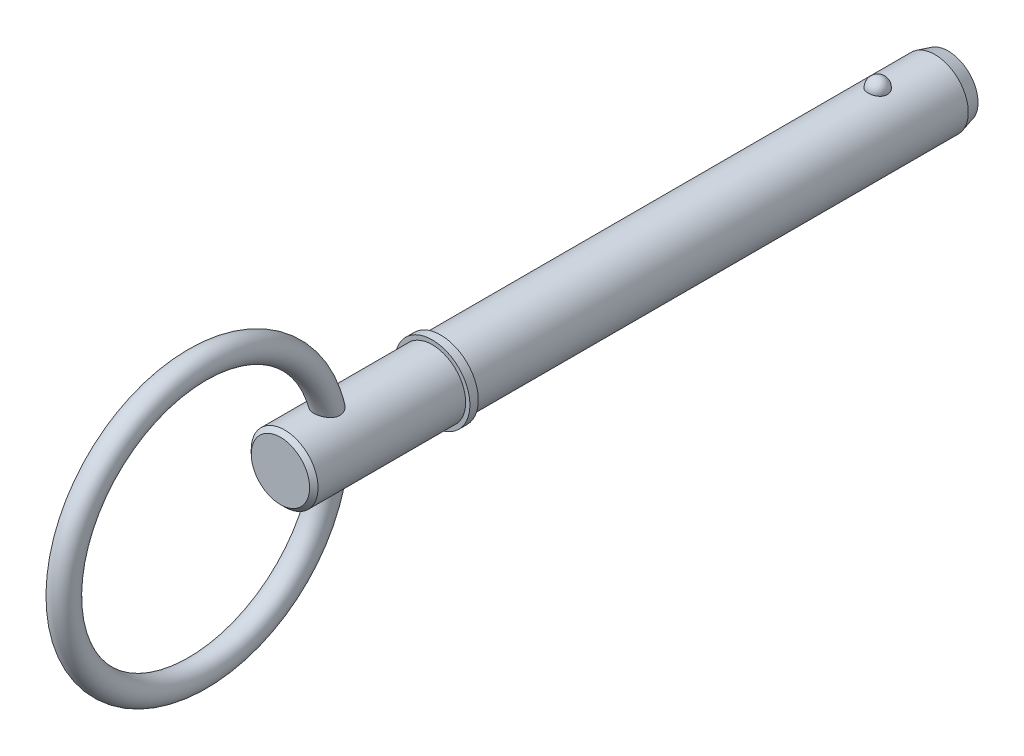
ISO-10303-21;
HEADER;
FILE_DESCRIPTION(('STEP AP214'),'2;1');
FILE_NAME('part.step','',(''),(''),'','','');
FILE_SCHEMA(('AUTOMOTIVE_DESIGN { 1 0 10303 214 1 1 1 1 }'));
ENDSEC;
DATA;
#1=APPLICATION_CONTEXT('core data for automotive mechanical design processes');
#2=APPLICATION_PROTOCOL_DEFINITION('international standard','automotive_design',2000,#1);
#3=PRODUCT_CONTEXT('',#1,'mechanical');
#4=PRODUCT('Part','Part','',(#3));
#5=PRODUCT_RELATED_PRODUCT_CATEGORY('part','',(#4));
#6=PRODUCT_DEFINITION_FORMATION('','',#4);
#7=PRODUCT_DEFINITION_CONTEXT('part definition',#1,'design');
#8=PRODUCT_DEFINITION('design','',#6,#7);
#9=PRODUCT_DEFINITION_SHAPE('','',#8);
#10=(LENGTH_UNIT() NAMED_UNIT(*) SI_UNIT(.MILLI.,.METRE.));
#11=(NAMED_UNIT(*) PLANE_ANGLE_UNIT() SI_UNIT($,.RADIAN.));
#12=(NAMED_UNIT(*) SI_UNIT($,.STERADIAN.) SOLID_ANGLE_UNIT());
#13=UNCERTAINTY_MEASURE_WITH_UNIT(LENGTH_MEASURE(1.E-05),#10,'distance_accuracy_value','');
#14=(GEOMETRIC_REPRESENTATION_CONTEXT(3) GLOBAL_UNCERTAINTY_ASSIGNED_CONTEXT((#13)) GLOBAL_UNIT_ASSIGNED_CONTEXT((#10,
#11,#12)) REPRESENTATION_CONTEXT('',''));
#15=CARTESIAN_POINT('',(0.,0.,0.));
#16=DIRECTION('',(0.,0.,1.));
#17=DIRECTION('',(1.,0.,0.));
#18=AXIS2_PLACEMENT_3D('',#15,#16,#17);
#19=CARTESIAN_POINT('',(0.,0.,50.8));
#20=DIRECTION('',(0.,0.,-1.));
#21=DIRECTION('',(-1.,0.,0.));
#22=AXIS2_PLACEMENT_3D('',#19,#20,#21);
#23=CYLINDRICAL_SURFACE('',#22,3.97);
#24=CARTESIAN_POINT('',(1.13787398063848,3.80343828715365,-1.15));
#25=CARTESIAN_POINT('',(1.13787307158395,3.80343910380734,-1.0857397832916));
#26=CARTESIAN_POINT('',(1.13264657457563,3.80501406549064,-1.02146820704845));
#27=CARTESIAN_POINT('',(1.11186534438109,3.81113760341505,-0.894749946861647));
#28=CARTESIAN_POINT('',(1.09630734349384,3.81568712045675,-0.832303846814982));
#29=CARTESIAN_POINT('',(1.05525533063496,3.82724281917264,-0.711040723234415));
#30=CARTESIAN_POINT('',(1.02976565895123,3.83424792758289,-0.652222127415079));
#31=CARTESIAN_POINT('',(0.969477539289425,3.84993235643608,-0.53981446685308));
#32=CARTESIAN_POINT('',(0.934679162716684,3.85861166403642,-0.486225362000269));
#33=CARTESIAN_POINT('',(0.856427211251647,3.87673176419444,-0.385470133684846));
#34=CARTESIAN_POINT('',(0.812928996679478,3.88617632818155,-0.338339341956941));
#35=CARTESIAN_POINT('',(0.718506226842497,3.90473543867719,-0.252134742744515));
#36=CARTESIAN_POINT('',(0.667581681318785,3.91384998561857,-0.213060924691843));
#37=CARTESIAN_POINT('',(0.559829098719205,3.93070626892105,-0.144169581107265));
#38=CARTESIAN_POINT('',(0.503019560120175,3.93845211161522,-0.114324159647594));
#39=CARTESIAN_POINT('',(0.384957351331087,3.95173781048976,-0.0645874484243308));
#40=CARTESIAN_POINT('',(0.323705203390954,3.95727792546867,-0.0446949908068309));
#41=CARTESIAN_POINT('',(0.1997490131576,3.96544869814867,-0.0157294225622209));
#42=CARTESIAN_POINT('',(0.137095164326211,3.96813298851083,-0.00645660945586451));
#43=CARTESIAN_POINT('',(0.0110617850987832,3.97048461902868,0.00167939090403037));
#44=CARTESIAN_POINT('',(-0.0523176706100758,3.97015226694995,0.000543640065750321));
#45=CARTESIAN_POINT('',(-0.176983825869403,3.96653606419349,-0.0120046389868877));
#46=CARTESIAN_POINT('',(-0.238287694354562,3.96329719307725,-0.0232605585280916));
#47=CARTESIAN_POINT('',(-0.358077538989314,3.95427494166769,-0.0555133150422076));
#48=CARTESIAN_POINT('',(-0.41656346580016,3.94849151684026,-0.0765103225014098));
#49=CARTESIAN_POINT('',(-0.529474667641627,3.9349475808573,-0.127824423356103));
#50=CARTESIAN_POINT('',(-0.583873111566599,3.92717527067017,-0.158197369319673));
#51=CARTESIAN_POINT('',(-0.686796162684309,3.9104901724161,-0.227402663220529));
#52=CARTESIAN_POINT('',(-0.735320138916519,3.90157726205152,-0.266235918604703));
#53=CARTESIAN_POINT('',(-0.826197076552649,3.88336108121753,-0.352210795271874));
#54=CARTESIAN_POINT('',(-0.868404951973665,3.87405356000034,-0.399504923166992));
#55=CARTESIAN_POINT('',(-0.944393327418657,3.85623507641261,-0.500572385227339));
#56=CARTESIAN_POINT('',(-0.978173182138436,3.84772417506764,-0.554346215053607));
#57=CARTESIAN_POINT('',(-1.036841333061,3.83233550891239,-0.667624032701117));
#58=CARTESIAN_POINT('',(-1.06161430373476,3.82547928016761,-0.727190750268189));
#59=CARTESIAN_POINT('',(-1.1010562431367,3.81431496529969,-0.849806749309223));
#60=CARTESIAN_POINT('',(-1.11572551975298,3.81000680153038,-0.912855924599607));
#61=CARTESIAN_POINT('',(-1.13455293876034,3.80444307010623,-1.04035299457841));
#62=CARTESIAN_POINT('',(-1.13875701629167,3.80317416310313,-1.10479351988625));
#63=CARTESIAN_POINT('',(-1.13668244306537,3.80379469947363,-1.23348881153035));
#64=CARTESIAN_POINT('',(-1.13040410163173,3.80568404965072,-1.29774358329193));
#65=CARTESIAN_POINT('',(-1.10758455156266,3.81238701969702,-1.42388263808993));
#66=CARTESIAN_POINT('',(-1.09109911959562,3.81718474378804,-1.48577787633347));
#67=CARTESIAN_POINT('',(-1.04831897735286,3.82915360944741,-1.6058363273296));
#68=CARTESIAN_POINT('',(-1.02202385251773,3.83632485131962,-1.66399938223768));
#69=CARTESIAN_POINT('',(-0.960087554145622,3.85229234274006,-1.77531672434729));
#70=CARTESIAN_POINT('',(-0.924393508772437,3.86109769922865,-1.82844028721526));
#71=CARTESIAN_POINT('',(-0.844617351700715,3.87932868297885,-1.92784641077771));
#72=CARTESIAN_POINT('',(-0.800534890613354,3.88875433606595,-1.97412868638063));
#73=CARTESIAN_POINT('',(-0.704909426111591,3.90722138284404,-2.05875748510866));
#74=CARTESIAN_POINT('',(-0.653336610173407,3.91626104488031,-2.09707073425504));
#75=CARTESIAN_POINT('',(-0.544251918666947,3.93290335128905,-2.16444159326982));
#76=CARTESIAN_POINT('',(-0.486740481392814,3.94050610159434,-2.19349988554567));
#77=CARTESIAN_POINT('',(-0.368186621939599,3.95333328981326,-2.24120607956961));
#78=CARTESIAN_POINT('',(-0.307200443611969,3.9585876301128,-2.25998559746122));
#79=CARTESIAN_POINT('',(-0.182787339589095,3.96627905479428,-2.28716436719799));
#80=CARTESIAN_POINT('',(-0.119360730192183,3.96871650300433,-2.29556495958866));
#81=CARTESIAN_POINT('',(0.00676344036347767,3.97048518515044,-2.30167748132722));
#82=CARTESIAN_POINT('',(0.0694499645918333,3.96987797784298,-2.299601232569));
#83=CARTESIAN_POINT('',(0.193555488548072,3.96576491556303,-2.28530777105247));
#84=CARTESIAN_POINT('',(0.254974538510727,3.96225917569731,-2.27309096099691));
#85=CARTESIAN_POINT('',(0.374550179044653,3.95274547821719,-2.2389384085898));
#86=CARTESIAN_POINT('',(0.432719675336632,3.94674835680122,-2.2170447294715));
#87=CARTESIAN_POINT('',(0.544514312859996,3.93288448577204,-2.16414952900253));
#88=CARTESIAN_POINT('',(0.598139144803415,3.92501760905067,-2.13314738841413));
#89=CARTESIAN_POINT('',(0.700284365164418,3.90809781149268,-2.06228741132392));
#90=CARTESIAN_POINT('',(0.748708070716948,3.89902775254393,-2.02229434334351));
#91=CARTESIAN_POINT('',(0.838215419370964,3.88077133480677,-1.93481443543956));
#92=CARTESIAN_POINT('',(0.879297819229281,3.87158495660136,-1.88732632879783));
#93=CARTESIAN_POINT('',(0.953804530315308,3.85391414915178,-1.78516284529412));
#94=CARTESIAN_POINT('',(0.987071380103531,3.8454460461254,-1.73036973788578));
#95=CARTESIAN_POINT('',(1.04410491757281,3.83035507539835,-1.61582422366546));
#96=CARTESIAN_POINT('',(1.06787445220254,3.82373165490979,-1.5560733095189));
#97=CARTESIAN_POINT('',(1.10358064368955,3.813570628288,-1.43904746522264));
#98=CARTESIAN_POINT('',(1.11641754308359,3.80980198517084,-1.38206535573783));
#99=CARTESIAN_POINT('',(1.13356451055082,3.80473547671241,-1.26672526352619));
#100=CARTESIAN_POINT('',(1.13787480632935,3.80343754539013,-1.20836731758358));
#101=CARTESIAN_POINT('',(1.13787398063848,3.80343828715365,-1.15));
#102=B_SPLINE_CURVE_WITH_KNOTS('',3,(#24,#25,#26,#27,#28,#29,#30,#31,#32,#33,#34,#35,#36,#37,
#38,#39,#40,#41,#42,#43,#44,#45,#46,#47,#48,#49,#50,#51,#52,#53,#54,#55,#56,#57,#58,#59,#60,#61,
#62,#63,#64,#65,#66,#67,#68,#69,#70,#71,#72,#73,#74,#75,#76,#77,#78,#79,#80,#81,#82,#83,#84,#85,
#86,#87,#88,#89,#90,#91,#92,#93,#94,#95,#96,#97,#98,#99,#100,#101),.UNSPECIFIED.,.T.,.F.,(4,2,2,
2,2,2,2,2,2,2,2,2,2,2,2,2,2,2,2,2,2,2,2,2,2,2,2,2,2,2,2,2,2,2,2,2,2,2,4),(0.,0.192571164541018,
0.385203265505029,0.577751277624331,0.770297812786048,0.963858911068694,1.15741975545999,
1.35038964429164,1.54333688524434,1.73259288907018,1.92182958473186,2.10818732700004,
2.2945483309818,2.48204164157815,2.66955507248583,2.86087083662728,3.05220124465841,
3.24590171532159,3.43959628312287,3.63243915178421,3.82527632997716,4.01706893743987,
4.20886965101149,4.40177324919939,4.59468488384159,4.78838651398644,4.9820738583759,
5.17321934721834,5.36434014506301,5.55161251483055,5.7388774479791,5.92533626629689,
6.11180776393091,6.30129785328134,6.49082000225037,6.68388392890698,6.87688993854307,
7.05180628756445,7.22671796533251),.UNSPECIFIED.);
#103=CARTESIAN_POINT('',(1.13787398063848,3.80343828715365,-1.15));
#104=VERTEX_POINT('',#103);
#105=EDGE_CURVE('E102',#104,#104,#102,.T.);
#106=ORIENTED_EDGE('',*,*,#105,.T.);
#107=EDGE_LOOP('',(#106));
#108=FACE_BOUND('',#107,.T.);
#109=CARTESIAN_POINT('',(0.,0.,-7.94399999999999));
#110=DIRECTION('',(0.,0.,-1.));
#111=DIRECTION('',(-1.,0.,0.));
#112=AXIS2_PLACEMENT_3D('',#109,#110,#111);
#113=CIRCLE('',#112,3.97);
#114=CARTESIAN_POINT('',(-3.97,0.,-7.94399999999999));
#115=VERTEX_POINT('',#114);
#116=EDGE_CURVE('E110',#115,#115,#113,.F.);
#117=ORIENTED_EDGE('',*,*,#116,.T.);
#118=EDGE_LOOP('',(#117));
#119=FACE_BOUND('',#118,.T.);
#120=CARTESIAN_POINT('',(0.,0.,50.8));
#121=DIRECTION('',(0.,0.,1.));
#122=DIRECTION('',(1.,0.,0.));
#123=AXIS2_PLACEMENT_3D('',#120,#121,#122);
#124=CIRCLE('',#123,3.97);
#125=CARTESIAN_POINT('',(3.97,0.,50.8));
#126=VERTEX_POINT('',#125);
#127=EDGE_CURVE('E108',#126,#126,#124,.T.);
#128=ORIENTED_EDGE('',*,*,#127,.F.);
#129=EDGE_LOOP('',(#128));
#130=FACE_BOUND('',#129,.T.);
#131=ADVANCED_FACE('F39',(#108,#119,#130),#23,.T.);
#132=CARTESIAN_POINT('',(0.,0.,-9.53));
#133=DIRECTION('',(0.,0.,-1.));
#134=DIRECTION('',(-1.,0.,0.));
#135=AXIS2_PLACEMENT_3D('',#132,#133,#134);
#136=PLANE('',#135);
#137=CARTESIAN_POINT('',(0.,0.,-9.53));
#138=DIRECTION('',(0.,0.,-1.));
#139=DIRECTION('',(-1.,0.,0.));
#140=AXIS2_PLACEMENT_3D('',#137,#138,#139);
#141=CIRCLE('',#140,3.54503258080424);
#142=CARTESIAN_POINT('',(-3.54503258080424,0.,-9.53));
#143=VERTEX_POINT('',#142);
#144=EDGE_CURVE('E142',#143,#143,#141,.T.);
#145=ORIENTED_EDGE('',*,*,#144,.T.);
#146=EDGE_LOOP('',(#145));
#147=FACE_BOUND('',#146,.T.);
#148=ADVANCED_FACE('F88',(#147),#136,.T.);
#149=CARTESIAN_POINT('',(0.,0.,-9.53));
#150=DIRECTION('',(0.,0.,1.));
#151=DIRECTION('',(1.,0.,0.));
#152=AXIS2_PLACEMENT_3D('',#149,#150,#151);
#153=CONICAL_SURFACE('',#152,3.54503258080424,0.261799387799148);
#154=ORIENTED_EDGE('',*,*,#116,.F.);
#155=EDGE_LOOP('',(#154));
#156=FACE_BOUND('',#155,.T.);
#157=ORIENTED_EDGE('',*,*,#144,.F.);
#158=EDGE_LOOP('',(#157));
#159=FACE_BOUND('',#158,.T.);
#160=ADVANCED_FACE('F94',(#156,#159),#153,.T.);
#161=CARTESIAN_POINT('',(0.,3.97,-1.15));
#162=DIRECTION('',(0.,1.,0.));
#163=DIRECTION('',(0.,0.,-1.));
#164=AXIS2_PLACEMENT_3D('',#161,#162,#163);
#165=SPHERICAL_SURFACE('',#164,1.15);
#166=ORIENTED_EDGE('',*,*,#105,.F.);
#167=EDGE_LOOP('',(#166));
#168=FACE_BOUND('',#167,.T.);
#169=ADVANCED_FACE('F113',(#168),#165,.T.);
#170=CARTESIAN_POINT('',(0.,0.,50.8));
#171=DIRECTION('',(0.,0.,-1.));
#172=DIRECTION('',(-1.,0.,0.));
#173=AXIS2_PLACEMENT_3D('',#170,#171,#172);
#174=PLANE('',#173);
#175=ORIENTED_EDGE('',*,*,#127,.T.);
#176=EDGE_LOOP('',(#175));
#177=FACE_BOUND('',#176,.T.);
#178=CARTESIAN_POINT('',(0.,0.,50.8));
#179=DIRECTION('',(0.,0.,-1.));
#180=DIRECTION('',(-1.,0.,0.));
#181=AXIS2_PLACEMENT_3D('',#178,#179,#180);
#182=CIRCLE('',#181,4.47);
#183=CARTESIAN_POINT('',(-4.47,0.,50.8));
#184=VERTEX_POINT('',#183);
#185=EDGE_CURVE('E109',#184,#184,#182,.T.);
#186=ORIENTED_EDGE('',*,*,#185,.T.);
#187=EDGE_LOOP('',(#186));
#188=FACE_BOUND('',#187,.T.);
#189=ADVANCED_FACE('F117',(#177,#188),#174,.T.);
#190=CARTESIAN_POINT('',(0.,0.,33.7287874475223));
#191=DIRECTION('',(0.,0.,-1.));
#192=DIRECTION('',(-1.,0.,0.));
#193=AXIS2_PLACEMENT_3D('',#190,#191,#192);
#194=CYLINDRICAL_SURFACE('',#193,4.47);
#195=CARTESIAN_POINT('',(0.,0.,51.8));
#196=DIRECTION('',(0.,0.,-1.));
#197=DIRECTION('',(-1.,0.,0.));
#198=AXIS2_PLACEMENT_3D('',#195,#196,#197);
#199=CIRCLE('',#198,4.47);
#200=CARTESIAN_POINT('',(-4.47,0.,51.8));
#201=VERTEX_POINT('',#200);
#202=EDGE_CURVE('E134',#201,#201,#199,.T.);
#203=ORIENTED_EDGE('',*,*,#202,.T.);
#204=EDGE_LOOP('',(#203));
#205=FACE_BOUND('',#204,.T.);
#206=ORIENTED_EDGE('',*,*,#185,.F.);
#207=EDGE_LOOP('',(#206));
#208=FACE_BOUND('',#207,.T.);
#209=ADVANCED_FACE('F121',(#205,#208),#194,.T.);
#210=CARTESIAN_POINT('',(0.,4.47,51.8));
#211=DIRECTION('',(0.,0.,1.));
#212=DIRECTION('',(1.,0.,0.));
#213=AXIS2_PLACEMENT_3D('',#210,#211,#212);
#214=PLANE('',#213);
#215=CARTESIAN_POINT('',(0.,0.,51.8));
#216=DIRECTION('',(0.,0.,1.));
#217=DIRECTION('',(1.,0.,0.));
#218=AXIS2_PLACEMENT_3D('',#215,#216,#217);
#219=CIRCLE('',#218,3.97);
#220=CARTESIAN_POINT('',(3.97,0.,51.8));
#221=VERTEX_POINT('',#220);
#222=EDGE_CURVE('E112',#221,#221,#219,.T.);
#223=ORIENTED_EDGE('',*,*,#222,.F.);
#224=EDGE_LOOP('',(#223));
#225=FACE_BOUND('',#224,.T.);
#226=ORIENTED_EDGE('',*,*,#202,.F.);
#227=EDGE_LOOP('',(#226));
#228=FACE_BOUND('',#227,.T.);
#229=ADVANCED_FACE('F85',(#225,#228),#214,.T.);
#230=CARTESIAN_POINT('',(0.,0.,69.85));
#231=DIRECTION('',(0.,0.,-1.));
#232=DIRECTION('',(-1.,0.,0.));
#233=AXIS2_PLACEMENT_3D('',#230,#231,#232);
#234=CYLINDRICAL_SURFACE('',#233,3.97);
#235=CARTESIAN_POINT('',(-0.740636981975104,-3.90030215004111,62.9942081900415));
#236=CARTESIAN_POINT('',(-0.667733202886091,-3.91414543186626,62.954930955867));
#237=CARTESIAN_POINT('',(-0.591347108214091,-3.92651643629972,62.9215983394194));
#238=CARTESIAN_POINT('',(-0.43370932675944,-3.94703799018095,62.8675410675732));
#239=CARTESIAN_POINT('',(-0.352458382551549,-3.95518918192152,62.8468144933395));
#240=CARTESIAN_POINT('',(-0.187320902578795,-3.96644185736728,62.8184263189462));
#241=CARTESIAN_POINT('',(-0.103433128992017,-3.9695409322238,62.8107709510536));
#242=CARTESIAN_POINT('',(0.064529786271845,-3.97036376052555,62.8087268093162));
#243=CARTESIAN_POINT('',(0.148604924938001,-3.96808759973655,62.8143378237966));
#244=CARTESIAN_POINT('',(0.313967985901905,-3.95842655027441,62.8386101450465));
#245=CARTESIAN_POINT('',(0.395270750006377,-3.95107581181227,62.8571842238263));
#246=CARTESIAN_POINT('',(0.553418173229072,-3.93204472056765,62.9068699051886));
#247=CARTESIAN_POINT('',(0.630262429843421,-3.92036397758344,62.9379826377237));
#248=CARTESIAN_POINT('',(0.777983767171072,-3.89375421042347,63.0123739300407));
#249=CARTESIAN_POINT('',(0.848809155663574,-3.8788003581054,63.0557462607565));
#250=CARTESIAN_POINT('',(0.981880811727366,-3.84727071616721,63.1536515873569));
#251=CARTESIAN_POINT('',(1.04412630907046,-3.83069478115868,63.2081855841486));
#252=CARTESIAN_POINT('',(1.15846819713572,-3.79768496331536,63.3274397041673));
#253=CARTESIAN_POINT('',(1.21053047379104,-3.78125172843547,63.3921927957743));
#254=CARTESIAN_POINT('',(1.30266807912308,-3.75050988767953,63.5301698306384));
#255=CARTESIAN_POINT('',(1.34274789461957,-3.73620048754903,63.6033905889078));
#256=CARTESIAN_POINT('',(1.40857853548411,-3.71187334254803,63.7536278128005));
#257=CARTESIAN_POINT('',(1.43477198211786,-3.70172571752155,63.8304292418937));
#258=CARTESIAN_POINT('',(1.47426417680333,-3.68617713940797,63.9877211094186));
#259=CARTESIAN_POINT('',(1.48756557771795,-3.68077520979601,64.068210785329));
#260=CARTESIAN_POINT('',(1.5011302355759,-3.67526295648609,64.2282774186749));
#261=CARTESIAN_POINT('',(1.50172918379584,-3.67501639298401,64.3078221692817));
#262=CARTESIAN_POINT('',(1.4912869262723,-3.67926498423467,64.4660010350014));
#263=CARTESIAN_POINT('',(1.48024221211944,-3.68376156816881,64.5446348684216));
#264=CARTESIAN_POINT('',(1.44631002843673,-3.69722026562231,64.7039961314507));
#265=CARTESIAN_POINT('',(1.42273446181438,-3.7064405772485,64.7845537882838));
#266=CARTESIAN_POINT('',(1.36440745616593,-3.72830487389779,64.9410229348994));
#267=CARTESIAN_POINT('',(1.32965006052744,-3.74095068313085,65.0169319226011));
#268=CARTESIAN_POINT('',(1.244983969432,-3.77003365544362,65.1715893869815));
#269=CARTESIAN_POINT('',(1.19374759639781,-3.78674477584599,65.2495625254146));
#270=CARTESIAN_POINT('',(1.07927226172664,-3.82094743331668,65.396060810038));
#271=CARTESIAN_POINT('',(1.0160234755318,-3.83843960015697,65.4645781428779));
#272=CARTESIAN_POINT('',(0.875824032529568,-3.87288453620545,65.5922425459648));
#273=CARTESIAN_POINT('',(0.798445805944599,-3.88979192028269,65.6509375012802));
#274=CARTESIAN_POINT('',(0.633271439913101,-3.92005992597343,65.7524486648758));
#275=CARTESIAN_POINT('',(0.545492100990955,-3.9334261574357,65.7952900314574));
#276=CARTESIAN_POINT('',(0.374503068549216,-3.9531041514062,65.8573026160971));
#277=CARTESIAN_POINT('',(0.29225018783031,-3.96011991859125,65.8788718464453));
#278=CARTESIAN_POINT('',(0.124887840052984,-3.96891507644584,65.9058171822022));
#279=CARTESIAN_POINT('',(0.039782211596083,-3.97070123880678,65.911214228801));
#280=CARTESIAN_POINT('',(-0.116598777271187,-3.96893737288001,65.9058414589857));
#281=CARTESIAN_POINT('',(-0.187977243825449,-3.96616998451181,65.8974431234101));
#282=CARTESIAN_POINT('',(-0.32822445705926,-3.95703238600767,65.8693459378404));
#283=CARTESIAN_POINT('',(-0.397092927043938,-3.95066177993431,65.8496458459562));
#284=CARTESIAN_POINT('',(-0.53077782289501,-3.93493622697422,65.8000024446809));
#285=CARTESIAN_POINT('',(-0.595585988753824,-3.92557541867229,65.7700390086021));
#286=CARTESIAN_POINT('',(-0.719890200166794,-3.904694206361,65.7012213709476));
#287=CARTESIAN_POINT('',(-0.779384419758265,-3.89317306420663,65.6623641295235));
#288=CARTESIAN_POINT('',(-0.900171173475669,-3.86715924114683,65.5711356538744));
#289=CARTESIAN_POINT('',(-0.960570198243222,-3.85247602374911,65.5176378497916));
#290=CARTESIAN_POINT('',(-1.07286582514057,-3.82272677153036,65.4024377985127));
#291=CARTESIAN_POINT('',(-1.12475588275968,-3.8076604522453,65.3407293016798));
#292=CARTESIAN_POINT('',(-1.22682603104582,-3.7761197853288,65.2003072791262));
#293=CARTESIAN_POINT('',(-1.27547686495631,-3.75979238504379,65.1204426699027));
#294=CARTESIAN_POINT('',(-1.35956460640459,-3.73021138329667,64.9534537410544));
#295=CARTESIAN_POINT('',(-1.39499536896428,-3.71695921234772,64.8663260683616));
#296=CARTESIAN_POINT('',(-1.45224550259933,-3.6949785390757,64.6837644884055));
#297=CARTESIAN_POINT('',(-1.47355906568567,-3.68641985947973,64.5881485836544));
#298=CARTESIAN_POINT('',(-1.49891316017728,-3.67618897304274,64.3943060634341));
#299=CARTESIAN_POINT('',(-1.50297414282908,-3.67450861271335,64.2960826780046));
#300=CARTESIAN_POINT('',(-1.49322338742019,-3.67847743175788,64.1115204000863));
#301=CARTESIAN_POINT('',(-1.48132891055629,-3.68334053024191,64.025062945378));
#302=CARTESIAN_POINT('',(-1.44277978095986,-3.69860964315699,63.8560202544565));
#303=CARTESIAN_POINT('',(-1.41613105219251,-3.70901343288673,63.7734334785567));
#304=CARTESIAN_POINT('',(-1.35164005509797,-3.73296583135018,63.6217432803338));
#305=CARTESIAN_POINT('',(-1.31494998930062,-3.74616939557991,63.5520907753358));
#306=CARTESIAN_POINT('',(-1.23078033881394,-3.77465882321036,63.4201142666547));
#307=CARTESIAN_POINT('',(-1.18329862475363,-3.78994509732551,63.3577917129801));
#308=CARTESIAN_POINT('',(-1.07555346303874,-3.82196646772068,63.238244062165));
#309=CARTESIAN_POINT('',(-1.01467770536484,-3.83873247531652,63.1815789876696));
#310=CARTESIAN_POINT('',(-0.883925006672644,-3.87093079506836,63.079334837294));
#311=CARTESIAN_POINT('',(-0.814046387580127,-3.88636285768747,63.0337578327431));
#312=CARTESIAN_POINT('',(-0.740636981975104,-3.90030215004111,62.9942081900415));
#313=B_SPLINE_CURVE_WITH_KNOTS('',3,(#235,#236,#237,#238,#239,#240,#241,#242,#243,#244,#245,
#246,#247,#248,#249,#250,#251,#252,#253,#254,#255,#256,#257,#258,#259,#260,#261,#262,#263,#264,
#265,#266,#267,#268,#269,#270,#271,#272,#273,#274,#275,#276,#277,#278,#279,#280,#281,#282,#283,
#284,#285,#286,#287,#288,#289,#290,#291,#292,#293,#294,#295,#296,#297,#298,#299,#300,#301,#302,
#303,#304,#305,#306,#307,#308,#309,#310,#311,#312),.UNSPECIFIED.,.T.,.F.,(4,2,2,2,2,2,2,2,2,2,2,
2,2,2,2,2,2,2,2,2,2,2,2,2,2,2,2,2,2,2,2,2,2,2,2,2,2,2,4),(0.,0.251585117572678,
0.503131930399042,0.754798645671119,1.00646134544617,1.25644674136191,1.50645467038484,
1.75842915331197,2.01042624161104,2.26325358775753,2.51598614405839,2.76008726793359,
3.00413815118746,3.24173115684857,3.47939577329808,3.7317117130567,3.9841622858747,
4.26728153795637,4.55063334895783,4.84469622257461,5.13829042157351,5.39265192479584,
5.6466839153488,5.86142364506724,6.07618697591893,6.29137389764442,6.50663447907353,
6.75172833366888,6.99700982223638,7.28055118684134,7.56422418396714,7.85757857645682,
8.15058512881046,8.41135406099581,8.67201836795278,8.91039015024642,9.14880900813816,
9.40209172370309,9.65542171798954),.UNSPECIFIED.);
#314=CARTESIAN_POINT('',(-0.740636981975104,-3.90030215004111,62.9942081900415));
#315=VERTEX_POINT('',#314);
#316=EDGE_CURVE('E10',#315,#315,#313,.T.);
#317=ORIENTED_EDGE('',*,*,#316,.F.);
#318=EDGE_LOOP('',(#317));
#319=FACE_BOUND('',#318,.T.);
#320=CARTESIAN_POINT('',(-0.740636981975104,3.90030215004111,62.9942081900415));
#321=CARTESIAN_POINT('',(-0.813118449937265,3.88653971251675,63.0332571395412));
#322=CARTESIAN_POINT('',(-0.882149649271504,3.8713229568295,63.0781781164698));
#323=CARTESIAN_POINT('',(-1.01146335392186,3.83956738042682,63.1788428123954));
#324=CARTESIAN_POINT('',(-1.07174704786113,3.82302873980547,63.2345850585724));
#325=CARTESIAN_POINT('',(-1.18196955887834,3.79040422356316,63.3557938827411));
#326=CARTESIAN_POINT('',(-1.23189269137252,3.77431906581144,63.4212749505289));
#327=CARTESIAN_POINT('',(-1.31978443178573,3.74449359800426,63.5602948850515));
#328=CARTESIAN_POINT('',(-1.35775694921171,3.73075252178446,63.6338311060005));
#329=CARTESIAN_POINT('',(-1.41974909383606,3.7075981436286,63.7847128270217));
#330=CARTESIAN_POINT('',(-1.44413408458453,3.69807309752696,63.8618910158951));
#331=CARTESIAN_POINT('',(-1.4800654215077,3.6838411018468,64.019590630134));
#332=CARTESIAN_POINT('',(-1.49161368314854,3.67913343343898,64.1001115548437));
#333=CARTESIAN_POINT('',(-1.50187378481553,3.67495610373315,64.2602618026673));
#334=CARTESIAN_POINT('',(-1.50086613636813,3.67537197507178,64.3398709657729));
#335=CARTESIAN_POINT('',(-1.48728932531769,3.68088569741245,64.4979172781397));
#336=CARTESIAN_POINT('',(-1.47471654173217,3.68598501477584,64.5763540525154));
#337=CARTESIAN_POINT('',(-1.43761932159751,3.70061780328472,64.7355940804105));
#338=CARTESIAN_POINT('',(-1.41233843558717,3.71042990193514,64.8161940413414));
#339=CARTESIAN_POINT('',(-1.35057314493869,3.73335405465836,64.9724850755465));
#340=CARTESIAN_POINT('',(-1.31408239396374,3.74646797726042,65.0481733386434));
#341=CARTESIAN_POINT('',(-1.2257172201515,3.77636700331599,65.2020428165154));
#342=CARTESIAN_POINT('',(-1.17251505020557,3.79340436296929,65.2794161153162));
#343=CARTESIAN_POINT('',(-1.05406412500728,3.82800923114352,65.4243069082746));
#344=CARTESIAN_POINT('',(-0.988806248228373,3.84557713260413,65.4918168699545));
#345=CARTESIAN_POINT('',(-0.845287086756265,3.87968695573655,65.6162211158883));
#346=CARTESIAN_POINT('',(-0.766724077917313,3.89618874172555,65.6727822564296));
#347=CARTESIAN_POINT('',(-0.599538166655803,3.92537936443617,65.7696962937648));
#348=CARTESIAN_POINT('',(-0.510933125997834,3.93807482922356,65.8100774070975));
#349=CARTESIAN_POINT('',(-0.339677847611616,3.95624165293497,65.8670085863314));
#350=CARTESIAN_POINT('',(-0.257968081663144,3.96248273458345,65.8861280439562));
#351=CARTESIAN_POINT('',(-0.0922002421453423,3.96979198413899,65.9084736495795));
#352=CARTESIAN_POINT('',(-0.00814495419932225,3.97086604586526,65.9117179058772));
#353=CARTESIAN_POINT('',(0.146484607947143,3.96793776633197,65.9027977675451));
#354=CARTESIAN_POINT('',(0.217212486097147,3.96466338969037,65.8928433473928));
#355=CARTESIAN_POINT('',(0.355938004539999,3.95462310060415,65.8618888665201));
#356=CARTESIAN_POINT('',(0.423935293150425,3.94785673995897,65.840887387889));
#357=CARTESIAN_POINT('',(0.556534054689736,3.93137424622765,65.7886148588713));
#358=CARTESIAN_POINT('',(0.621075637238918,3.92161865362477,65.7572059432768));
#359=CARTESIAN_POINT('',(0.744663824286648,3.90004074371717,65.6855756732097));
#360=CARTESIAN_POINT('',(0.803708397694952,3.88821766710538,65.6453510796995));
#361=CARTESIAN_POINT('',(0.923664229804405,3.86161149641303,65.5510569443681));
#362=CARTESIAN_POINT('',(0.983622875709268,3.84664723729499,65.4958282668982));
#363=CARTESIAN_POINT('',(1.09477654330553,3.816501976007,65.3771942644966));
#364=CARTESIAN_POINT('',(1.14596459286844,3.80132081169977,65.3137825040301));
#365=CARTESIAN_POINT('',(1.24603510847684,3.76980809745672,65.1699890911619));
#366=CARTESIAN_POINT('',(1.29338223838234,3.753652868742,65.0884933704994));
#367=CARTESIAN_POINT('',(1.37450267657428,3.72471527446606,64.9183960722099));
#368=CARTESIAN_POINT('',(1.40827109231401,3.71193412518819,64.8297919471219));
#369=CARTESIAN_POINT('',(1.46140533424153,3.6913461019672,64.6455436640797));
#370=CARTESIAN_POINT('',(1.48042991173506,3.6836576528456,64.5497859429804));
#371=CARTESIAN_POINT('',(1.50115029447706,3.67526750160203,64.3561286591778));
#372=CARTESIAN_POINT('',(1.50286713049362,3.67455732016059,64.2582318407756));
#373=CARTESIAN_POINT('',(1.48878143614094,3.68028077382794,64.0752085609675));
#374=CARTESIAN_POINT('',(1.47496153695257,3.68590609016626,63.9899028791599));
#375=CARTESIAN_POINT('',(1.43287242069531,3.70247002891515,63.8234763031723));
#376=CARTESIAN_POINT('',(1.40460762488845,3.7134070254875,63.7423541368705));
#377=CARTESIAN_POINT('',(1.33714680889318,3.7381964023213,63.5931046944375));
#378=CARTESIAN_POINT('',(1.29898330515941,3.7517524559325,63.5244572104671));
#379=CARTESIAN_POINT('',(1.21206000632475,3.78072797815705,63.3946829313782));
#380=CARTESIAN_POINT('',(1.16329942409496,3.79614758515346,63.3335566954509));
#381=CARTESIAN_POINT('',(1.05526740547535,3.82760231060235,63.2188656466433));
#382=CARTESIAN_POINT('',(0.995782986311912,3.84364346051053,63.1655033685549));
#383=CARTESIAN_POINT('',(0.868651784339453,3.8743538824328,63.0690998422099));
#384=CARTESIAN_POINT('',(0.80100358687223,3.88902291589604,63.0260603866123));
#385=CARTESIAN_POINT('',(0.656696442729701,3.91602140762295,62.9497891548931));
#386=CARTESIAN_POINT('',(0.579799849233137,3.92824686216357,62.9169691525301));
#387=CARTESIAN_POINT('',(0.421219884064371,3.94839960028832,62.8640374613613));
#388=CARTESIAN_POINT('',(0.339536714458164,3.95632706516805,62.8439252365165));
#389=CARTESIAN_POINT('',(0.173681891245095,3.96706909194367,62.8168661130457));
#390=CARTESIAN_POINT('',(0.0895101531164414,3.96988347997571,62.8099196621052));
#391=CARTESIAN_POINT('',(-0.0788915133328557,3.97010941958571,62.8093589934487));
#392=CARTESIAN_POINT('',(-0.163121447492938,3.96752031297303,62.8157463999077));
#393=CARTESIAN_POINT('',(-0.332911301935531,3.9569711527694,62.8422872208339));
#394=CARTESIAN_POINT('',(-0.41836320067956,3.9487768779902,62.8630414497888));
#395=CARTESIAN_POINT('',(-0.584033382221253,3.92769448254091,62.9184250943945));
#396=CARTESIAN_POINT('',(-0.66425117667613,3.91480592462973,62.9530558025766));
#397=CARTESIAN_POINT('',(-0.740636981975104,3.90030215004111,62.9942081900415));
#398=B_SPLINE_CURVE_WITH_KNOTS('',3,(#320,#321,#322,#323,#324,#325,#326,#327,#328,#329,#330,
#331,#332,#333,#334,#335,#336,#337,#338,#339,#340,#341,#342,#343,#344,#345,#346,#347,#348,#349,
#350,#351,#352,#353,#354,#355,#356,#357,#358,#359,#360,#361,#362,#363,#364,#365,#366,#367,#368,
#369,#370,#371,#372,#373,#374,#375,#376,#377,#378,#379,#380,#381,#382,#383,#384,#385,#386,#387,
#388,#389,#390,#391,#392,#393,#394,#395,#396,#397),.UNSPECIFIED.,.T.,.F.,(4,2,2,2,2,2,2,2,2,2,2,
2,2,2,2,2,2,2,2,2,2,2,2,2,2,2,2,2,2,2,2,2,2,2,2,2,2,2,4),(0.,0.250115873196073,0.50019772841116,
0.750655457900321,1.00103116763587,1.24430196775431,1.48753646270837,1.72534678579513,
1.96323159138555,2.2173360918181,2.47158471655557,2.75662009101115,3.0418720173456,
3.33477180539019,3.62715855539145,3.87803518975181,4.12862559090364,4.34211896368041,
4.55563974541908,4.7721103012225,4.98866052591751,5.23635199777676,5.48423946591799,
5.76983687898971,6.05553710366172,6.34766729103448,6.63944246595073,6.89782349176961,
7.15612548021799,7.39414671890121,7.63218564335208,7.87561406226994,8.11908472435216,
8.37137533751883,8.62365530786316,8.87594385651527,9.12826313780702,9.39182737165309,
9.65541616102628),.UNSPECIFIED.);
#399=CARTESIAN_POINT('',(-0.740636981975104,3.90030215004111,62.9942081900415));
#400=VERTEX_POINT('',#399);
#401=EDGE_CURVE('E51',#400,#400,#398,.T.);
#402=ORIENTED_EDGE('',*,*,#401,.F.);
#403=EDGE_LOOP('',(#402));
#404=FACE_BOUND('',#403,.T.);
#405=CARTESIAN_POINT('',(0.,0.,69.35));
#406=DIRECTION('',(0.,0.,-1.));
#407=DIRECTION('',(-1.,0.,0.));
#408=AXIS2_PLACEMENT_3D('',#405,#406,#407);
#409=CIRCLE('',#408,3.97);
#410=CARTESIAN_POINT('',(-3.97,0.,69.35));
#411=VERTEX_POINT('',#410);
#412=EDGE_CURVE('E64',#411,#411,#409,.T.);
#413=ORIENTED_EDGE('',*,*,#412,.T.);
#414=EDGE_LOOP('',(#413));
#415=FACE_BOUND('',#414,.T.);
#416=ORIENTED_EDGE('',*,*,#222,.T.);
#417=EDGE_LOOP('',(#416));
#418=FACE_BOUND('',#417,.T.);
#419=ADVANCED_FACE('F69',(#319,#404,#415,#418),#234,.T.);
#420=CARTESIAN_POINT('',(0.,0.,69.85));
#421=DIRECTION('',(0.,0.,-1.));
#422=DIRECTION('',(-1.,0.,0.));
#423=AXIS2_PLACEMENT_3D('',#420,#421,#422);
#424=PLANE('',#423);
#425=CARTESIAN_POINT('',(0.,0.,69.85));
#426=DIRECTION('',(0.,0.,-1.));
#427=DIRECTION('',(-1.,0.,0.));
#428=AXIS2_PLACEMENT_3D('',#425,#426,#427);
#429=CIRCLE('',#428,3.46999999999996);
#430=CARTESIAN_POINT('',(-3.46999999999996,0.,69.85));
#431=VERTEX_POINT('',#430);
#432=EDGE_CURVE('E58',#431,#431,#429,.F.);
#433=ORIENTED_EDGE('',*,*,#432,.T.);
#434=EDGE_LOOP('',(#433));
#435=FACE_BOUND('',#434,.T.);
#436=ADVANCED_FACE('F76',(#435),#424,.F.);
#437=CARTESIAN_POINT('',(0.,0.,69.35));
#438=DIRECTION('',(0.,0.,-1.));
#439=DIRECTION('',(-1.,0.,0.));
#440=AXIS2_PLACEMENT_3D('',#437,#438,#439);
#441=CONICAL_SURFACE('',#440,3.97,0.785398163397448);
#442=ORIENTED_EDGE('',*,*,#432,.F.);
#443=EDGE_LOOP('',(#442));
#444=FACE_BOUND('',#443,.T.);
#445=ORIENTED_EDGE('',*,*,#412,.F.);
#446=EDGE_LOOP('',(#445));
#447=FACE_BOUND('',#446,.T.);
#448=ADVANCED_FACE('F41',(#444,#447),#441,.T.);
#449=CARTESIAN_POINT('',(0.,0.,79.725));
#450=DIRECTION('',(1.,0.,0.));
#451=DIRECTION('',(0.,0.,-1.));
#452=AXIS2_PLACEMENT_3D('',#449,#450,#451);
#453=TOROIDAL_SURFACE('',#452,15.875,1.5);
#454=ORIENTED_EDGE('',*,*,#316,.T.);
#455=EDGE_LOOP('',(#454));
#456=FACE_BOUND('',#455,.T.);
#457=ORIENTED_EDGE('',*,*,#401,.T.);
#458=EDGE_LOOP('',(#457));
#459=FACE_BOUND('',#458,.T.);
#460=ADVANCED_FACE('F73',(#456,#459),#453,.T.);
#461=CLOSED_SHELL('',(#131,#148,#160,#169,#189,#209,#229,#419,#436,#448,#460));
#462=MANIFOLD_SOLID_BREP('B2',#461);
#463=ADVANCED_BREP_SHAPE_REPRESENTATION('',(#18,#462),#14);
#464=SHAPE_DEFINITION_REPRESENTATION(#9,#463);
ENDSEC;
END-ISO-10303-21;
